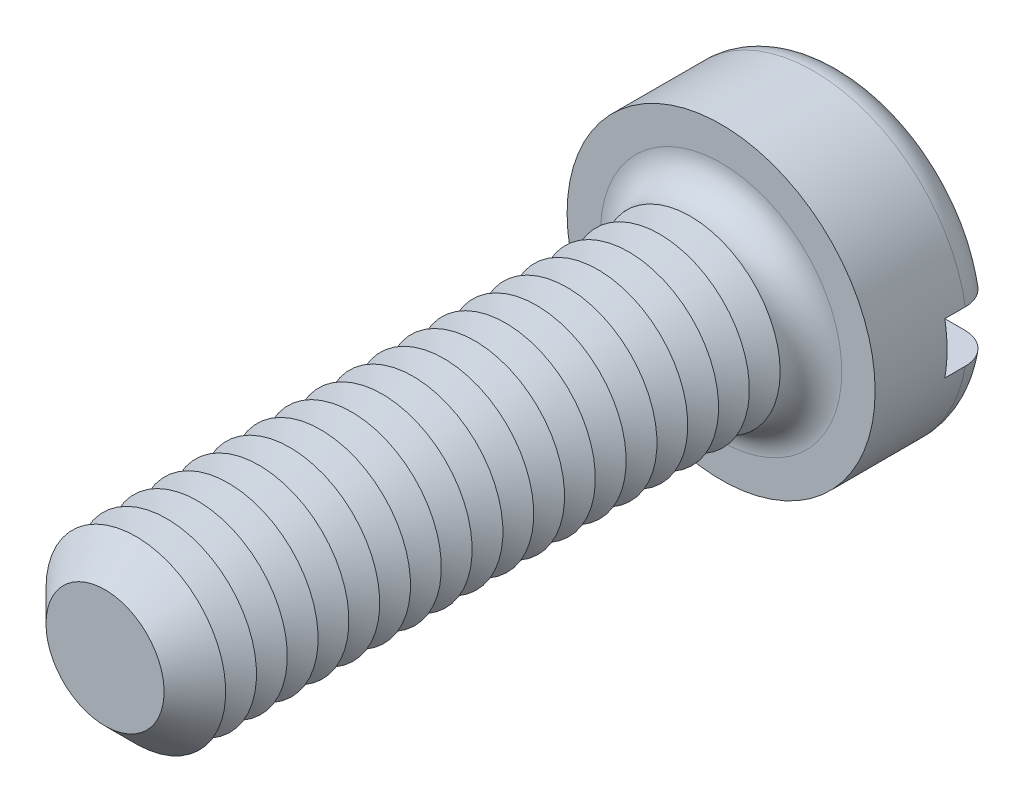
from build123d import *

# Parameters (mm, degrees)
SKETCH3_R           = 3
BOSS_EXTRUDE2_DEPTH = 2.4
SKETCH4_R           = 1.75
BOSS_EXTRUDE3_DEPTH = 12
FILLET1_R           = 0.6
CHAMFER1_SIZE       = 0.6
LPATTERN1_COUNT     = 18
LPATTERN1_PITCH     = 0.6
SKETCH8_W           = 6
SKETCH8_H           = 1
CUT_EXTRUDE1_DEPTH  = 1


with BuildPart() as part:
    # Sketch3 → Boss-Extrude2 (new body)
    with BuildSketch(Plane.XY):
        Circle(SKETCH3_R)
    extrude(amount=-BOSS_EXTRUDE2_DEPTH)

    # Sketch4 → Boss-Extrude3 (add)
    with BuildSketch(Plane.XY):
        Circle(SKETCH4_R)
    extrude(amount=BOSS_EXTRUDE3_DEPTH)

    # Fillet1
    fillet1_edges = [part.edges().sort_by_distance(p)[0] for p in [
        (-3, 0, -2.4),
        (-1.75, 0, 0),
    ]]
    fillet(fillet1_edges, radius=FILLET1_R)

    # Chamfer1
    chamfer1_edges = [part.edges().sort_by_distance(p)[0] for p in [
        (-1.75, 0, 12),
    ]]
    chamfer(chamfer1_edges, length=CHAMFER1_SIZE)

    # Sketch6 → Cut-Revolve1 (revolve, cut)
    with BuildSketch(Plane(origin=(0, 0, 0), x_dir=(0, 0, -1), z_dir=(1, 0, 0)), mode=Mode.PRIVATE) as cut_revolve1_sk:
        Polygon((-0.6, 1.75), (-0.9, 1.230384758), (-1.2, 1.75), align=None)
    cut_revolve1 = revolve(cut_revolve1_sk.sketch.rotate(Axis((0, 0, -1.694361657), (0, 0, 1)), 90), axis=Axis((0, 0, -1.694361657), (0, 0, 1)), mode=Mode.SUBTRACT)

    # LPattern1: Cut-Revolve1 ×18
    with Locations(*[(0, 0, i * LPATTERN1_PITCH) for i in range(1, LPATTERN1_COUNT)]):
        add(cut_revolve1, mode=Mode.SUBTRACT)

    # Sketch8 → Cut-Extrude1 (cut)
    with BuildSketch(Plane(origin=(0, 0, -2.4), x_dir=(-1, 0, 0), z_dir=(0, 0, -1))):
        Rectangle(SKETCH8_W, SKETCH8_H)
    extrude(amount=-CUT_EXTRUDE1_DEPTH, mode=Mode.SUBTRACT)


solid = part.part
